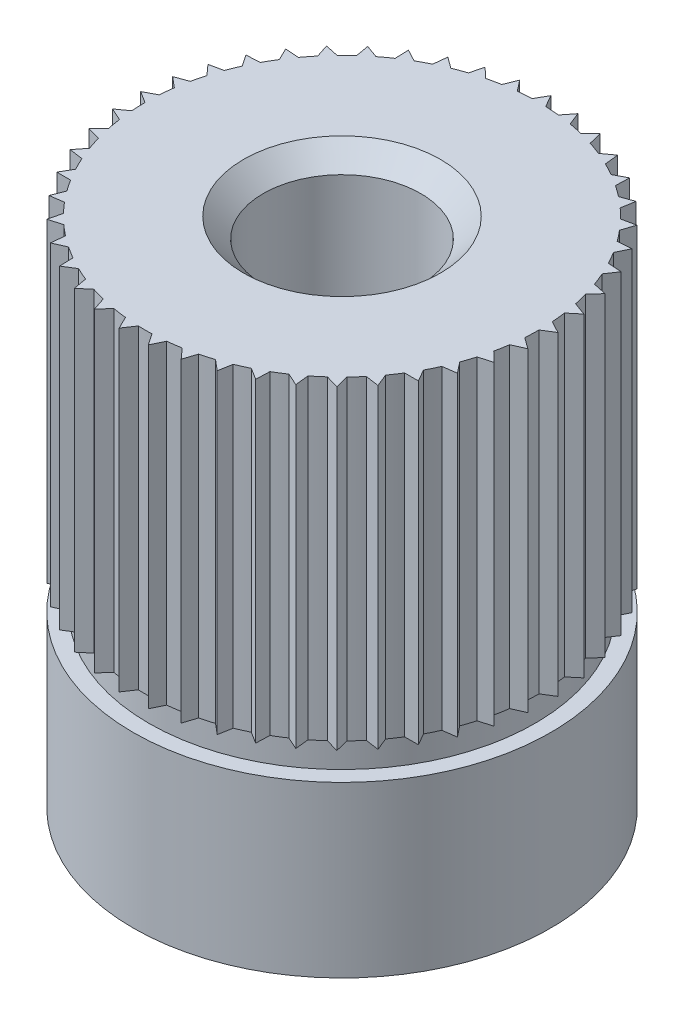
from build123d import *

# Parameters (mm, degrees)
SCHIZZO1_R                   = 2.65
ESTRUSIONE_ESTRUSIONE1_DEPTH = 2.15
SCHIZZO2_R                   = 2.55
ESTRUSIONE_ESTRUSIONE2_DEPTH = 0.35
ESTRUSIONE_ESTRUSIONE3_DEPTH = 4
SCHIZZO4_R                   = 2.5
ESTRUSIONE_ESTRUSIONE4_DEPTH = 4
RIPETIZIONECIRCOLARE1_COUNT  = 45
SCHIZZO5_R                   = 1
TAGLIO_ESTRUSIONE1_DEPTH     = 8.5029994
SMUSSO1_SIZE                 = 0.25
SCHIZZO6_R                   = 2.75
SCHIZZO6_R_2                 = 2.45
TAGLIO_ESTRUSIONE2_DEPTH     = 0.35


with BuildPart() as part:
    # Schizzo1 → Estrusione-Estrusione1 (new body)
    with BuildSketch(Plane(origin=(0, 0, 0), x_dir=(1, 0, 0), z_dir=(0, 1, 0))):
        with Locations(Location((0, 0, 0), (0, 0, 90))):
            Circle(SCHIZZO1_R)
    extrude(amount=ESTRUSIONE_ESTRUSIONE1_DEPTH)

    # Schizzo2 → Estrusione-Estrusione2 (add)
    with BuildSketch(Plane(origin=(0, 2.15, 0), x_dir=(1, 0, 0), z_dir=(0, 1, 0))):
        with Locations(Location((0, 0, 0), (0, 0, 270))):
            Circle(SCHIZZO2_R)
    extrude(amount=ESTRUSIONE_ESTRUSIONE2_DEPTH)

    # Schizzo3 → Estrusione-Estrusione3 (add)
    with BuildSketch(Plane(origin=(0, 2.5, 0), x_dir=(1, 0, 0), z_dir=(0, 1, 0))):
        with BuildLine():
            Line((0, 2.65), (-0.087486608, 2.49846875))
            ThreePointArc((-0.087486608, 2.49846875), (0, 2.5), (0.087486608, 2.49846875))
            Line((0.087486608, 2.49846875), (0, 2.65))
        make_face()
    estrusione_estrusione3 = extrude(amount=ESTRUSIONE_ESTRUSIONE3_DEPTH)

    # Schizzo4 → Estrusione-Estrusione4 (add)
    with BuildSketch(Plane(origin=(0, 2.5, 0), x_dir=(1, 0, 0), z_dir=(0, 1, 0))):
        Circle(SCHIZZO4_R)
    extrude(amount=ESTRUSIONE_ESTRUSIONE4_DEPTH)

    # RipetizioneCircolare1: Estrusione-Estrusione3 ×45 about axis
    ripetizionecircolare1_axis = Axis((0, 0, 0), (0, 1, 0))
    for i in range(1, RIPETIZIONECIRCOLARE1_COUNT):
        add(estrusione_estrusione3.rotate(ripetizionecircolare1_axis, i * 360 / RIPETIZIONECIRCOLARE1_COUNT))

    # Schizzo5 → Taglio-Estrusione1 (cut, through all)
    with BuildSketch(Plane(origin=(0, 6.5, 0), x_dir=(1, 0, 0), z_dir=(0, 1, 0))):
        with Locations(Location((0, 0, 0), (0, 0, 270))):
            Circle(SCHIZZO5_R)
    extrude(amount=-TAGLIO_ESTRUSIONE1_DEPTH, mode=Mode.SUBTRACT)

    # Smusso1
    smusso1_edges = [part.edges().sort_by_distance(p)[0] for p in [
        (0, 6.5, -1),
    ]]
    chamfer(smusso1_edges, length=SMUSSO1_SIZE)

    # Schizzo6 → Taglio-Estrusione2 (cut)
    with BuildSketch(Plane(origin=(0, 2.15, 0), x_dir=(1, 0, 0), z_dir=(0, 1, 0))):
        Circle(SCHIZZO6_R)
        with Locations(Location((0, 0, 0), (0, 0, 270))):
            Circle(SCHIZZO6_R_2, mode=Mode.SUBTRACT)
    extrude(amount=TAGLIO_ESTRUSIONE2_DEPTH, mode=Mode.SUBTRACT)


solid = part.part
